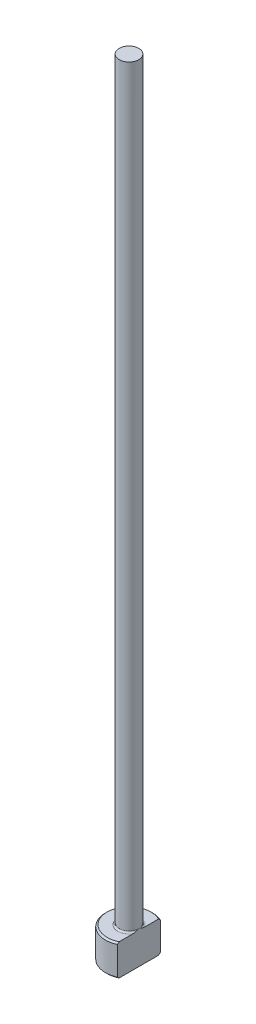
from build123d import *
from build123d.topology import SkipClean

# Parameters (mm, degrees)
CHAMFER1_SIZE    = 0.2
FILLET1_R        = 0.2
KEYED_HEAD_DEPTH = 101.089959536


with BuildPart() as part:
    # Sketch1 → Revolve1 (revolve)
    with BuildSketch(Plane.XY, mode=Mode.PRIVATE) as revolve1_sk:
        Polygon((0, 0), (-3, 0), (-3, 4), (-1.25, 4), (-1.25, 100), (0, 100), align=None)
    revolve(revolve1_sk.sketch.rotate(Axis((0, 259.958771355, 0), (0, -1, 0)), 270), axis=Axis((0, 259.958771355, 0), (0, -1, 0)))

    # Chamfer1
    chamfer1_edges = [part.edges().sort_by_distance(p)[0] for p in [
        (0, 4, -3),
        (0, 0, -3),
    ]]
    chamfer(chamfer1_edges, length=CHAMFER1_SIZE)

    # Fillet1
    fillet1_edges = [part.edges().sort_by_distance(p)[0] for p in [
        (0, 4, -1.25),
    ]]
    fillet(fillet1_edges, radius=FILLET1_R)

    # Sketch2 → KEYED HEAD (cut, through all)
    with SkipClean():  # the faces are left unmerged after this step: merging them gives an invalid solid
        with BuildSketch(Plane(origin=(0, 0, 0), x_dir=(1, 0, 0), z_dir=(0, 1, 0))):
            with BuildLine():
                Line((1.25, -2.727178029), (1.25, 2.727178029))
                ThreePointArc((1.25, 2.727178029), (3, 0), (1.25, -2.727178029))
            make_face()
        extrude(amount=KEYED_HEAD_DEPTH, mode=Mode.SUBTRACT)


solid = part.part
